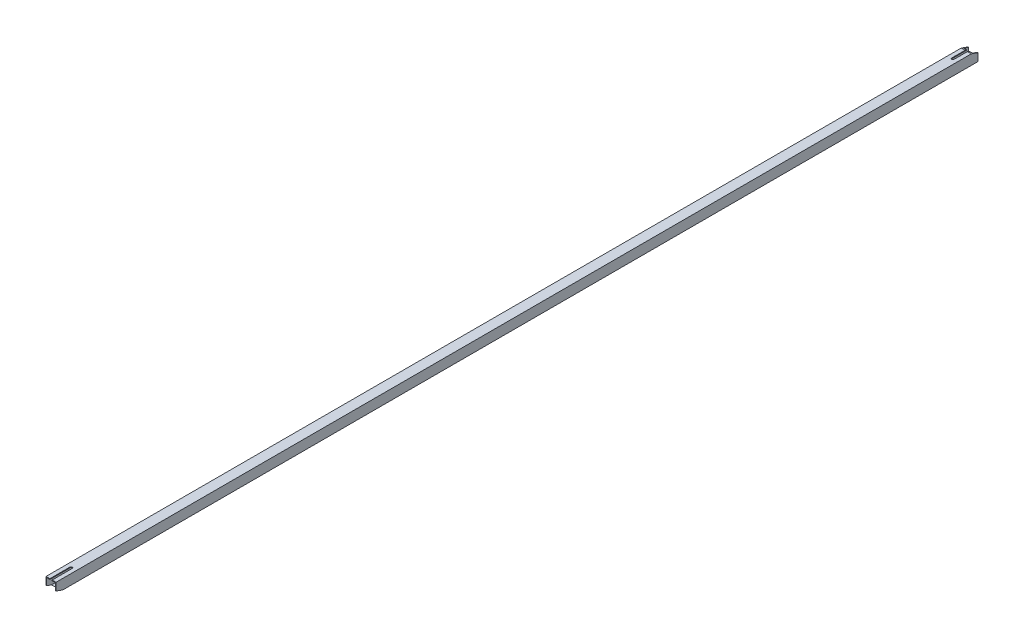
ISO-10303-21;
HEADER;
FILE_DESCRIPTION(('STEP AP214'),'2;1');
FILE_NAME('part.step','',(''),(''),'','','');
FILE_SCHEMA(('AUTOMOTIVE_DESIGN { 1 0 10303 214 1 1 1 1 }'));
ENDSEC;
DATA;
#1=APPLICATION_CONTEXT('core data for automotive mechanical design processes');
#2=APPLICATION_PROTOCOL_DEFINITION('international standard','automotive_design',2000,#1);
#3=PRODUCT_CONTEXT('',#1,'mechanical');
#4=PRODUCT('Part','Part','',(#3));
#5=PRODUCT_RELATED_PRODUCT_CATEGORY('part','',(#4));
#6=PRODUCT_DEFINITION_FORMATION('','',#4);
#7=PRODUCT_DEFINITION_CONTEXT('part definition',#1,'design');
#8=PRODUCT_DEFINITION('design','',#6,#7);
#9=PRODUCT_DEFINITION_SHAPE('','',#8);
#10=(LENGTH_UNIT() NAMED_UNIT(*) SI_UNIT(.MILLI.,.METRE.));
#11=(NAMED_UNIT(*) PLANE_ANGLE_UNIT() SI_UNIT($,.RADIAN.));
#12=(NAMED_UNIT(*) SI_UNIT($,.STERADIAN.) SOLID_ANGLE_UNIT());
#13=UNCERTAINTY_MEASURE_WITH_UNIT(LENGTH_MEASURE(1.E-05),#10,'distance_accuracy_value','');
#14=(GEOMETRIC_REPRESENTATION_CONTEXT(3) GLOBAL_UNCERTAINTY_ASSIGNED_CONTEXT((#13)) GLOBAL_UNIT_ASSIGNED_CONTEXT((#10,
#11,#12)) REPRESENTATION_CONTEXT('',''));
#15=CARTESIAN_POINT('',(0.,0.,0.));
#16=DIRECTION('',(0.,0.,1.));
#17=DIRECTION('',(1.,0.,0.));
#18=AXIS2_PLACEMENT_3D('',#15,#16,#17);
#19=CARTESIAN_POINT('',(7.,-40.,5379.965454));
#20=DIRECTION('',(1.,0.,0.));
#21=DIRECTION('',(0.,1.,0.));
#22=AXIS2_PLACEMENT_3D('',#19,#20,#21);
#23=PLANE('',#22);
#24=DIRECTION('',(0.,0.,1.));
#25=VECTOR('',#24,1.);
#26=CARTESIAN_POINT('',(7.,26.,2689.982727));
#27=LINE('',#26,#25);
#28=CARTESIAN_POINT('',(7.,26.,5379.965454));
#29=VERTEX_POINT('',#28);
#30=CARTESIAN_POINT('',(7.,26.,5499.965454));
#31=VERTEX_POINT('',#30);
#32=EDGE_CURVE('E403',#29,#31,#27,.T.);
#33=ORIENTED_EDGE('',*,*,#32,.T.);
#34=DIRECTION('',(0.,1.,0.));
#35=VECTOR('',#34,1.);
#36=CARTESIAN_POINT('',(7.,-20.,5499.965454));
#37=LINE('',#36,#35);
#38=CARTESIAN_POINT('',(7.,30.,5499.965454));
#39=VERTEX_POINT('',#38);
#40=EDGE_CURVE('E585',#31,#39,#37,.T.);
#41=ORIENTED_EDGE('',*,*,#40,.T.);
#42=DIRECTION('',(0.,0.,1.));
#43=VECTOR('',#42,1.);
#44=CARTESIAN_POINT('',(7.,30.,2689.982727));
#45=LINE('',#44,#43);
#46=CARTESIAN_POINT('',(7.,30.,5379.965454));
#47=VERTEX_POINT('',#46);
#48=EDGE_CURVE('E381',#47,#39,#45,.T.);
#49=ORIENTED_EDGE('',*,*,#48,.F.);
#50=DIRECTION('',(0.,1.,0.));
#51=VECTOR('',#50,1.);
#52=CARTESIAN_POINT('',(7.,-40.,5379.965454));
#53=LINE('',#52,#51);
#54=EDGE_CURVE('E10',#29,#47,#53,.T.);
#55=ORIENTED_EDGE('',*,*,#54,.F.);
#56=EDGE_LOOP('',(#33,#41,#49,#55));
#57=FACE_BOUND('',#56,.T.);
#58=ADVANCED_FACE('F16',(#57),#23,.F.);
#59=CARTESIAN_POINT('',(0.,-40.,5379.965454));
#60=DIRECTION('',(0.,1.,0.));
#61=DIRECTION('',(0.,0.,1.));
#62=AXIS2_PLACEMENT_3D('',#59,#60,#61);
#63=CYLINDRICAL_SURFACE('',#62,7.);
#64=ORIENTED_EDGE('',*,*,#54,.T.);
#65=CARTESIAN_POINT('',(0.,30.,5379.965454));
#66=DIRECTION('',(0.,1.,0.));
#67=DIRECTION('',(0.,0.,1.));
#68=AXIS2_PLACEMENT_3D('',#65,#66,#67);
#69=CIRCLE('',#68,7.);
#70=CARTESIAN_POINT('',(-7.,30.,5379.965454));
#71=VERTEX_POINT('',#70);
#72=EDGE_CURVE('E377',#47,#71,#69,.T.);
#73=ORIENTED_EDGE('',*,*,#72,.T.);
#74=DIRECTION('',(0.,1.,0.));
#75=VECTOR('',#74,1.);
#76=CARTESIAN_POINT('',(-7.,-40.,5379.965454));
#77=LINE('',#76,#75);
#78=CARTESIAN_POINT('',(-7.,26.,5379.965454));
#79=VERTEX_POINT('',#78);
#80=EDGE_CURVE('E19',#79,#71,#77,.T.);
#81=ORIENTED_EDGE('',*,*,#80,.F.);
#82=CARTESIAN_POINT('',(0.,26.,5379.965454));
#83=DIRECTION('',(0.,1.,0.));
#84=DIRECTION('',(0.,0.,1.));
#85=AXIS2_PLACEMENT_3D('',#82,#83,#84);
#86=CIRCLE('',#85,7.);
#87=EDGE_CURVE('E599',#29,#79,#86,.T.);
#88=ORIENTED_EDGE('',*,*,#87,.F.);
#89=EDGE_LOOP('',(#64,#73,#81,#88));
#90=FACE_BOUND('',#89,.T.);
#91=ADVANCED_FACE('F625',(#90),#63,.F.);
#92=CARTESIAN_POINT('',(-7.,-40.,5379.965454));
#93=DIRECTION('',(1.,0.,0.));
#94=DIRECTION('',(0.,1.,0.));
#95=AXIS2_PLACEMENT_3D('',#92,#93,#94);
#96=PLANE('',#95);
#97=ORIENTED_EDGE('',*,*,#80,.T.);
#98=DIRECTION('',(0.,0.,1.));
#99=VECTOR('',#98,1.);
#100=CARTESIAN_POINT('',(-7.,30.,2689.982727));
#101=LINE('',#100,#99);
#102=CARTESIAN_POINT('',(-7.,30.,5499.965454));
#103=VERTEX_POINT('',#102);
#104=EDGE_CURVE('E382',#71,#103,#101,.T.);
#105=ORIENTED_EDGE('',*,*,#104,.T.);
#106=DIRECTION('',(0.,1.,0.));
#107=VECTOR('',#106,1.);
#108=CARTESIAN_POINT('',(-7.,-20.,5499.965454));
#109=LINE('',#108,#107);
#110=CARTESIAN_POINT('',(-7.,26.,5499.965454));
#111=VERTEX_POINT('',#110);
#112=EDGE_CURVE('E340',#111,#103,#109,.T.);
#113=ORIENTED_EDGE('',*,*,#112,.F.);
#114=DIRECTION('',(0.,0.,1.));
#115=VECTOR('',#114,1.);
#116=CARTESIAN_POINT('',(-7.,26.,2689.982727));
#117=LINE('',#116,#115);
#118=EDGE_CURVE('E603',#79,#111,#117,.T.);
#119=ORIENTED_EDGE('',*,*,#118,.F.);
#120=EDGE_LOOP('',(#97,#105,#113,#119));
#121=FACE_BOUND('',#120,.T.);
#122=ADVANCED_FACE('F618',(#121),#96,.T.);
#123=CARTESIAN_POINT('',(0.,-40.,120.));
#124=DIRECTION('',(0.,1.,0.));
#125=DIRECTION('',(0.,0.,1.));
#126=AXIS2_PLACEMENT_3D('',#123,#124,#125);
#127=CYLINDRICAL_SURFACE('',#126,7.);
#128=CARTESIAN_POINT('',(0.,26.,120.));
#129=DIRECTION('',(0.,1.,0.));
#130=DIRECTION('',(0.,0.,1.));
#131=AXIS2_PLACEMENT_3D('',#128,#129,#130);
#132=CIRCLE('',#131,7.);
#133=CARTESIAN_POINT('',(-7.,26.,120.));
#134=VERTEX_POINT('',#133);
#135=CARTESIAN_POINT('',(0.,26.,127.));
#136=VERTEX_POINT('',#135);
#137=EDGE_CURVE('E555',#134,#136,#132,.T.);
#138=ORIENTED_EDGE('',*,*,#137,.F.);
#139=DIRECTION('',(0.,1.,0.));
#140=VECTOR('',#139,1.);
#141=CARTESIAN_POINT('',(-7.,-40.,120.));
#142=LINE('',#141,#140);
#143=CARTESIAN_POINT('',(-7.,30.,120.));
#144=VERTEX_POINT('',#143);
#145=EDGE_CURVE('E536',#134,#144,#142,.T.);
#146=ORIENTED_EDGE('',*,*,#145,.T.);
#147=CARTESIAN_POINT('',(0.,30.,120.));
#148=DIRECTION('',(0.,1.,0.));
#149=DIRECTION('',(0.,0.,1.));
#150=AXIS2_PLACEMENT_3D('',#147,#148,#149);
#151=CIRCLE('',#150,7.);
#152=CARTESIAN_POINT('',(0.,30.,127.));
#153=VERTEX_POINT('',#152);
#154=EDGE_CURVE('E575',#144,#153,#151,.T.);
#155=ORIENTED_EDGE('',*,*,#154,.T.);
#156=DIRECTION('',(0.,1.,0.));
#157=VECTOR('',#156,1.);
#158=CARTESIAN_POINT('',(0.,-40.,127.));
#159=LINE('',#158,#157);
#160=EDGE_CURVE('E47',#136,#153,#159,.T.);
#161=ORIENTED_EDGE('',*,*,#160,.F.);
#162=EDGE_LOOP('',(#138,#146,#155,#161));
#163=FACE_BOUND('',#162,.T.);
#164=ADVANCED_FACE('F660',(#163),#127,.F.);
#165=CARTESIAN_POINT('',(0.,-40.,120.));
#166=DIRECTION('',(0.,1.,0.));
#167=DIRECTION('',(0.,0.,1.));
#168=AXIS2_PLACEMENT_3D('',#165,#166,#167);
#169=CYLINDRICAL_SURFACE('',#168,7.);
#170=DIRECTION('',(0.,1.,0.));
#171=VECTOR('',#170,1.);
#172=CARTESIAN_POINT('',(7.,-40.,120.));
#173=LINE('',#172,#171);
#174=CARTESIAN_POINT('',(7.,26.,120.));
#175=VERTEX_POINT('',#174);
#176=CARTESIAN_POINT('',(7.,30.,120.));
#177=VERTEX_POINT('',#176);
#178=EDGE_CURVE('E37',#175,#177,#173,.T.);
#179=ORIENTED_EDGE('',*,*,#178,.F.);
#180=CARTESIAN_POINT('',(0.,26.,120.));
#181=DIRECTION('',(0.,1.,0.));
#182=DIRECTION('',(0.,0.,1.));
#183=AXIS2_PLACEMENT_3D('',#180,#181,#182);
#184=CIRCLE('',#183,7.);
#185=EDGE_CURVE('E559',#136,#175,#184,.T.);
#186=ORIENTED_EDGE('',*,*,#185,.F.);
#187=ORIENTED_EDGE('',*,*,#160,.T.);
#188=CARTESIAN_POINT('',(0.,30.,120.));
#189=DIRECTION('',(0.,1.,0.));
#190=DIRECTION('',(0.,0.,1.));
#191=AXIS2_PLACEMENT_3D('',#188,#189,#190);
#192=CIRCLE('',#191,7.);
#193=EDGE_CURVE('E572',#153,#177,#192,.T.);
#194=ORIENTED_EDGE('',*,*,#193,.T.);
#195=EDGE_LOOP('',(#179,#186,#187,#194));
#196=FACE_BOUND('',#195,.T.);
#197=ADVANCED_FACE('F658',(#196),#169,.F.);
#198=CARTESIAN_POINT('',(7.,-40.,-1.));
#199=DIRECTION('',(1.,0.,0.));
#200=DIRECTION('',(0.,1.,0.));
#201=AXIS2_PLACEMENT_3D('',#198,#199,#200);
#202=PLANE('',#201);
#203=DIRECTION('',(0.,0.,1.));
#204=VECTOR('',#203,1.);
#205=CARTESIAN_POINT('',(7.,30.,-0.5));
#206=LINE('',#205,#204);
#207=CARTESIAN_POINT('',(7.,30.,40.055048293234));
#208=VERTEX_POINT('',#207);
#209=EDGE_CURVE('E512',#208,#177,#206,.T.);
#210=ORIENTED_EDGE('',*,*,#209,.F.);
#211=DIRECTION('',(0.,0.332002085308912,0.943278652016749));
#212=VECTOR('',#211,1.);
#213=CARTESIAN_POINT('',(7.,11.788086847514,-11.68832817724));
#214=LINE('',#213,#212);
#215=CARTESIAN_POINT('',(7.,26.,28.690316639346));
#216=VERTEX_POINT('',#215);
#217=EDGE_CURVE('E513',#216,#208,#214,.T.);
#218=ORIENTED_EDGE('',*,*,#217,.F.);
#219=DIRECTION('',(0.,0.,1.));
#220=VECTOR('',#219,1.);
#221=CARTESIAN_POINT('',(7.,26.,-0.5));
#222=LINE('',#221,#220);
#223=EDGE_CURVE('E539',#216,#175,#222,.T.);
#224=ORIENTED_EDGE('',*,*,#223,.T.);
#225=ORIENTED_EDGE('',*,*,#178,.T.);
#226=EDGE_LOOP('',(#210,#218,#224,#225));
#227=FACE_BOUND('',#226,.T.);
#228=ADVANCED_FACE('F657',(#227),#202,.F.);
#229=CARTESIAN_POINT('',(-7.,-40.,-1.));
#230=DIRECTION('',(1.,0.,0.));
#231=DIRECTION('',(0.,1.,0.));
#232=AXIS2_PLACEMENT_3D('',#229,#230,#231);
#233=PLANE('',#232);
#234=ORIENTED_EDGE('',*,*,#145,.F.);
#235=DIRECTION('',(0.,0.,1.));
#236=VECTOR('',#235,1.);
#237=CARTESIAN_POINT('',(-7.,26.,-0.5));
#238=LINE('',#237,#236);
#239=CARTESIAN_POINT('',(-7.,26.,28.690316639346));
#240=VERTEX_POINT('',#239);
#241=EDGE_CURVE('E560',#240,#134,#238,.T.);
#242=ORIENTED_EDGE('',*,*,#241,.F.);
#243=DIRECTION('',(0.,0.332002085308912,0.943278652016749));
#244=VECTOR('',#243,1.);
#245=CARTESIAN_POINT('',(-7.,11.788086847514,-11.68832817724));
#246=LINE('',#245,#244);
#247=CARTESIAN_POINT('',(-7.,30.,40.055048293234));
#248=VERTEX_POINT('',#247);
#249=EDGE_CURVE('E314',#240,#248,#246,.T.);
#250=ORIENTED_EDGE('',*,*,#249,.T.);
#251=DIRECTION('',(0.,0.,1.));
#252=VECTOR('',#251,1.);
#253=CARTESIAN_POINT('',(-7.,30.,-0.5));
#254=LINE('',#253,#252);
#255=EDGE_CURVE('E578',#248,#144,#254,.T.);
#256=ORIENTED_EDGE('',*,*,#255,.T.);
#257=EDGE_LOOP('',(#234,#242,#250,#256));
#258=FACE_BOUND('',#257,.T.);
#259=ADVANCED_FACE('F667',(#258),#233,.T.);
#260=CARTESIAN_POINT('',(26.,26.,0.));
#261=DIRECTION('',(0.,-1.,0.));
#262=DIRECTION('',(0.,0.,-1.));
#263=AXIS2_PLACEMENT_3D('',#260,#261,#262);
#264=PLANE('',#263);
#265=DIRECTION('',(-1.,0.,0.));
#266=VECTOR('',#265,1.);
#267=CARTESIAN_POINT('',(13.,26.,28.690316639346));
#268=LINE('',#267,#266);
#269=CARTESIAN_POINT('',(26.,26.,28.690316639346));
#270=VERTEX_POINT('',#269);
#271=EDGE_CURVE('E554',#270,#216,#268,.T.);
#272=ORIENTED_EDGE('',*,*,#271,.F.);
#273=DIRECTION('',(0.,0.,1.));
#274=VECTOR('',#273,1.);
#275=CARTESIAN_POINT('',(26.,26.,0.));
#276=LINE('',#275,#274);
#277=CARTESIAN_POINT('',(26.,26.,5499.965454));
#278=VERTEX_POINT('',#277);
#279=EDGE_CURVE('E546',#270,#278,#276,.T.);
#280=ORIENTED_EDGE('',*,*,#279,.T.);
#281=DIRECTION('',(-1.,0.,0.));
#282=VECTOR('',#281,1.);
#283=CARTESIAN_POINT('',(26.,26.,5499.965454));
#284=LINE('',#283,#282);
#285=EDGE_CURVE('E341',#278,#31,#284,.T.);
#286=ORIENTED_EDGE('',*,*,#285,.T.);
#287=ORIENTED_EDGE('',*,*,#32,.F.);
#288=ORIENTED_EDGE('',*,*,#87,.T.);
#289=ORIENTED_EDGE('',*,*,#118,.T.);
#290=DIRECTION('',(-1.,0.,0.));
#291=VECTOR('',#290,1.);
#292=CARTESIAN_POINT('',(26.,26.,5499.965454));
#293=LINE('',#292,#291);
#294=CARTESIAN_POINT('',(-26.,26.,5499.965454));
#295=VERTEX_POINT('',#294);
#296=EDGE_CURVE('E337',#111,#295,#293,.T.);
#297=ORIENTED_EDGE('',*,*,#296,.T.);
#298=DIRECTION('',(0.,0.,1.));
#299=VECTOR('',#298,1.);
#300=CARTESIAN_POINT('',(-26.,26.,0.));
#301=LINE('',#300,#299);
#302=CARTESIAN_POINT('',(-26.,26.,28.690316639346));
#303=VERTEX_POINT('',#302);
#304=EDGE_CURVE('E342',#303,#295,#301,.T.);
#305=ORIENTED_EDGE('',*,*,#304,.F.);
#306=DIRECTION('',(-1.,0.,0.));
#307=VECTOR('',#306,1.);
#308=CARTESIAN_POINT('',(13.,26.,28.690316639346));
#309=LINE('',#308,#307);
#310=EDGE_CURVE('E347',#240,#303,#309,.T.);
#311=ORIENTED_EDGE('',*,*,#310,.F.);
#312=ORIENTED_EDGE('',*,*,#241,.T.);
#313=ORIENTED_EDGE('',*,*,#137,.T.);
#314=ORIENTED_EDGE('',*,*,#185,.T.);
#315=ORIENTED_EDGE('',*,*,#223,.F.);
#316=EDGE_LOOP('',(#272,#280,#286,#287,#288,#289,#297,#305,#311,#312,#313,#314,#315));
#317=FACE_BOUND('',#316,.T.);
#318=ADVANCED_FACE('F637',(#317),#264,.T.);
#319=CARTESIAN_POINT('',(0.,0.,5499.965454));
#320=DIRECTION('',(0.,0.,1.));
#321=DIRECTION('',(1.,0.,0.));
#322=AXIS2_PLACEMENT_3D('',#319,#320,#321);
#323=PLANE('',#322);
#324=DIRECTION('',(-1.,0.,0.));
#325=VECTOR('',#324,1.);
#326=CARTESIAN_POINT('',(30.,30.,5499.965454));
#327=LINE('',#326,#325);
#328=CARTESIAN_POINT('',(-30.,30.,5499.965454));
#329=VERTEX_POINT('',#328);
#330=EDGE_CURVE('E582',#103,#329,#327,.T.);
#331=ORIENTED_EDGE('',*,*,#330,.T.);
#332=DIRECTION('',(0.,-1.,0.));
#333=VECTOR('',#332,1.);
#334=CARTESIAN_POINT('',(-30.,30.,5499.965454));
#335=LINE('',#334,#333);
#336=CARTESIAN_POINT('',(-30.,-15.9019819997,5499.965454));
#337=VERTEX_POINT('',#336);
#338=EDGE_CURVE('E330',#329,#337,#335,.T.);
#339=ORIENTED_EDGE('',*,*,#338,.T.);
#340=DIRECTION('',(-1.,0.,0.));
#341=VECTOR('',#340,1.);
#342=CARTESIAN_POINT('',(0.,-15.9019819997,5499.965454));
#343=LINE('',#342,#341);
#344=CARTESIAN_POINT('',(-26.,-15.9019819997,5499.965454));
#345=VERTEX_POINT('',#344);
#346=EDGE_CURVE('E331',#345,#337,#343,.T.);
#347=ORIENTED_EDGE('',*,*,#346,.F.);
#348=DIRECTION('',(0.,-1.,0.));
#349=VECTOR('',#348,1.);
#350=CARTESIAN_POINT('',(-26.,26.,5499.965454));
#351=LINE('',#350,#349);
#352=EDGE_CURVE('E346',#295,#345,#351,.T.);
#353=ORIENTED_EDGE('',*,*,#352,.F.);
#354=ORIENTED_EDGE('',*,*,#296,.F.);
#355=ORIENTED_EDGE('',*,*,#112,.T.);
#356=EDGE_LOOP('',(#331,#339,#347,#353,#354,#355));
#357=FACE_BOUND('',#356,.T.);
#358=ADVANCED_FACE('F632',(#357),#323,.T.);
#359=CARTESIAN_POINT('',(0.,0.,5499.965454));
#360=DIRECTION('',(0.,0.,1.));
#361=DIRECTION('',(1.,0.,0.));
#362=AXIS2_PLACEMENT_3D('',#359,#360,#361);
#363=PLANE('',#362);
#364=DIRECTION('',(-1.,0.,0.));
#365=VECTOR('',#364,1.);
#366=CARTESIAN_POINT('',(30.,30.,5499.965454));
#367=LINE('',#366,#365);
#368=CARTESIAN_POINT('',(30.,30.,5499.965454));
#369=VERTEX_POINT('',#368);
#370=EDGE_CURVE('E442',#369,#39,#367,.T.);
#371=ORIENTED_EDGE('',*,*,#370,.T.);
#372=ORIENTED_EDGE('',*,*,#40,.F.);
#373=ORIENTED_EDGE('',*,*,#285,.F.);
#374=DIRECTION('',(0.,1.,0.));
#375=VECTOR('',#374,1.);
#376=CARTESIAN_POINT('',(26.,-26.,5499.965454));
#377=LINE('',#376,#375);
#378=CARTESIAN_POINT('',(26.,-15.9019819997,5499.965454));
#379=VERTEX_POINT('',#378);
#380=EDGE_CURVE('E542',#379,#278,#377,.T.);
#381=ORIENTED_EDGE('',*,*,#380,.F.);
#382=DIRECTION('',(-1.,0.,0.));
#383=VECTOR('',#382,1.);
#384=CARTESIAN_POINT('',(0.,-15.9019819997,5499.965454));
#385=LINE('',#384,#383);
#386=CARTESIAN_POINT('',(30.,-15.9019819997,5499.965454));
#387=VERTEX_POINT('',#386);
#388=EDGE_CURVE('E386',#387,#379,#385,.T.);
#389=ORIENTED_EDGE('',*,*,#388,.F.);
#390=DIRECTION('',(0.,1.,0.));
#391=VECTOR('',#390,1.);
#392=CARTESIAN_POINT('',(30.,-30.,5499.965454));
#393=LINE('',#392,#391);
#394=EDGE_CURVE('E472',#387,#369,#393,.T.);
#395=ORIENTED_EDGE('',*,*,#394,.T.);
#396=EDGE_LOOP('',(#371,#372,#373,#381,#389,#395));
#397=FACE_BOUND('',#396,.T.);
#398=ADVANCED_FACE('F645',(#397),#363,.T.);
#399=CARTESIAN_POINT('',(30.,30.,0.));
#400=DIRECTION('',(0.,-1.,0.));
#401=DIRECTION('',(0.,0.,-1.));
#402=AXIS2_PLACEMENT_3D('',#399,#400,#401);
#403=PLANE('',#402);
#404=ORIENTED_EDGE('',*,*,#209,.T.);
#405=ORIENTED_EDGE('',*,*,#193,.F.);
#406=ORIENTED_EDGE('',*,*,#154,.F.);
#407=ORIENTED_EDGE('',*,*,#255,.F.);
#408=DIRECTION('',(-1.,0.,0.));
#409=VECTOR('',#408,1.);
#410=CARTESIAN_POINT('',(15.,30.,40.055048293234));
#411=LINE('',#410,#409);
#412=CARTESIAN_POINT('',(-30.,30.,40.055048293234));
#413=VERTEX_POINT('',#412);
#414=EDGE_CURVE('E412',#248,#413,#411,.T.);
#415=ORIENTED_EDGE('',*,*,#414,.T.);
#416=DIRECTION('',(0.,0.,1.));
#417=VECTOR('',#416,1.);
#418=CARTESIAN_POINT('',(-30.,30.,0.));
#419=LINE('',#418,#417);
#420=EDGE_CURVE('E519',#413,#329,#419,.T.);
#421=ORIENTED_EDGE('',*,*,#420,.T.);
#422=ORIENTED_EDGE('',*,*,#330,.F.);
#423=ORIENTED_EDGE('',*,*,#104,.F.);
#424=ORIENTED_EDGE('',*,*,#72,.F.);
#425=ORIENTED_EDGE('',*,*,#48,.T.);
#426=ORIENTED_EDGE('',*,*,#370,.F.);
#427=DIRECTION('',(0.,0.,1.));
#428=VECTOR('',#427,1.);
#429=CARTESIAN_POINT('',(30.,30.,0.));
#430=LINE('',#429,#428);
#431=CARTESIAN_POINT('',(30.,30.,40.055048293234));
#432=VERTEX_POINT('',#431);
#433=EDGE_CURVE('E468',#432,#369,#430,.T.);
#434=ORIENTED_EDGE('',*,*,#433,.F.);
#435=DIRECTION('',(-1.,0.,0.));
#436=VECTOR('',#435,1.);
#437=CARTESIAN_POINT('',(15.,30.,40.055048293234));
#438=LINE('',#437,#436);
#439=EDGE_CURVE('E508',#432,#208,#438,.T.);
#440=ORIENTED_EDGE('',*,*,#439,.T.);
#441=EDGE_LOOP('',(#404,#405,#406,#407,#415,#421,#422,#423,#424,#425,#426,#434,#440));
#442=FACE_BOUND('',#441,.T.);
#443=ADVANCED_FACE('F628',(#442),#403,.F.);
#444=CARTESIAN_POINT('',(0.,14.149179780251,-4.980031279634));
#445=DIRECTION('',(0.,-0.943278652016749,0.332002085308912));
#446=DIRECTION('',(-1.,0.,0.));
#447=AXIS2_PLACEMENT_3D('',#444,#445,#446);
#448=PLANE('',#447);
#449=ORIENTED_EDGE('',*,*,#271,.T.);
#450=ORIENTED_EDGE('',*,*,#217,.T.);
#451=ORIENTED_EDGE('',*,*,#439,.F.);
#452=DIRECTION('',(0.,0.332002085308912,0.943278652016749));
#453=VECTOR('',#452,1.);
#454=CARTESIAN_POINT('',(30.,12.495799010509,-9.677588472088));
#455=LINE('',#454,#453);
#456=CARTESIAN_POINT('',(30.,15.901981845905,0.));
#457=VERTEX_POINT('',#456);
#458=EDGE_CURVE('E464',#457,#432,#455,.T.);
#459=ORIENTED_EDGE('',*,*,#458,.F.);
#460=DIRECTION('',(1.,0.,0.));
#461=VECTOR('',#460,1.);
#462=CARTESIAN_POINT('',(0.,15.901981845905,0.));
#463=LINE('',#462,#461);
#464=CARTESIAN_POINT('',(26.,15.901981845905,0.));
#465=VERTEX_POINT('',#464);
#466=EDGE_CURVE('E392',#465,#457,#463,.T.);
#467=ORIENTED_EDGE('',*,*,#466,.F.);
#468=DIRECTION('',(0.,0.332002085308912,0.943278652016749));
#469=VECTOR('',#468,1.);
#470=CARTESIAN_POINT('',(26.,12.716249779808,-9.051247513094));
#471=LINE('',#470,#469);
#472=EDGE_CURVE('E550',#465,#270,#471,.T.);
#473=ORIENTED_EDGE('',*,*,#472,.T.);
#474=EDGE_LOOP('',(#449,#450,#451,#459,#467,#473));
#475=FACE_BOUND('',#474,.T.);
#476=ADVANCED_FACE('F652',(#475),#448,.F.);
#477=CARTESIAN_POINT('',(26.,-26.,0.));
#478=DIRECTION('',(-1.,0.,0.));
#479=DIRECTION('',(0.,0.,1.));
#480=AXIS2_PLACEMENT_3D('',#477,#478,#479);
#481=PLANE('',#480);
#482=DIRECTION('',(0.,1.,0.));
#483=VECTOR('',#482,1.);
#484=CARTESIAN_POINT('',(26.,-26.,0.));
#485=LINE('',#484,#483);
#486=CARTESIAN_POINT('',(26.,-26.,0.));
#487=VERTEX_POINT('',#486);
#488=EDGE_CURVE('E388',#487,#465,#485,.T.);
#489=ORIENTED_EDGE('',*,*,#488,.F.);
#490=DIRECTION('',(0.,0.,1.));
#491=VECTOR('',#490,1.);
#492=CARTESIAN_POINT('',(26.,-26.,0.));
#493=LINE('',#492,#491);
#494=CARTESIAN_POINT('',(26.,-26.,5471.275137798));
#495=VERTEX_POINT('',#494);
#496=EDGE_CURVE('E535',#487,#495,#493,.T.);
#497=ORIENTED_EDGE('',*,*,#496,.T.);
#498=DIRECTION('',(0.,-0.332002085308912,-0.943278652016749));
#499=VECTOR('',#498,1.);
#500=CARTESIAN_POINT('',(26.,-1738.008928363,607.14462282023));
#501=LINE('',#500,#499);
#502=EDGE_CURVE('E476',#379,#495,#501,.T.);
#503=ORIENTED_EDGE('',*,*,#502,.F.);
#504=ORIENTED_EDGE('',*,*,#380,.T.);
#505=ORIENTED_EDGE('',*,*,#279,.F.);
#506=ORIENTED_EDGE('',*,*,#472,.F.);
#507=EDGE_LOOP('',(#489,#497,#503,#504,#505,#506));
#508=FACE_BOUND('',#507,.T.);
#509=ADVANCED_FACE('F753',(#508),#481,.T.);
#510=CARTESIAN_POINT('',(-26.,-26.,0.));
#511=DIRECTION('',(0.,1.,0.));
#512=DIRECTION('',(1.,0.,0.));
#513=AXIS2_PLACEMENT_3D('',#510,#511,#512);
#514=PLANE('',#513);
#515=DIRECTION('',(1.,0.,0.));
#516=VECTOR('',#515,1.);
#517=CARTESIAN_POINT('',(-26.,-26.,0.));
#518=LINE('',#517,#516);
#519=CARTESIAN_POINT('',(-26.,-26.,0.));
#520=VERTEX_POINT('',#519);
#521=CARTESIAN_POINT('',(-7.,-26.,0.));
#522=VERTEX_POINT('',#521);
#523=EDGE_CURVE('E350',#520,#522,#518,.T.);
#524=ORIENTED_EDGE('',*,*,#523,.F.);
#525=DIRECTION('',(0.,0.,1.));
#526=VECTOR('',#525,1.);
#527=CARTESIAN_POINT('',(-26.,-26.,0.));
#528=LINE('',#527,#526);
#529=CARTESIAN_POINT('',(-26.,-26.,5471.275137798));
#530=VERTEX_POINT('',#529);
#531=EDGE_CURVE('E532',#520,#530,#528,.T.);
#532=ORIENTED_EDGE('',*,*,#531,.T.);
#533=DIRECTION('',(-1.,0.,0.));
#534=VECTOR('',#533,1.);
#535=CARTESIAN_POINT('',(-13.,-25.99999999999,5471.275137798));
#536=LINE('',#535,#534);
#537=CARTESIAN_POINT('',(-7.,-25.99999999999,5471.275137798));
#538=VERTEX_POINT('',#537);
#539=EDGE_CURVE('E428',#538,#530,#536,.T.);
#540=ORIENTED_EDGE('',*,*,#539,.F.);
#541=DIRECTION('',(0.,0.,-1.));
#542=VECTOR('',#541,1.);
#543=CARTESIAN_POINT('',(-7.,-26.,2689.982727));
#544=LINE('',#543,#542);
#545=CARTESIAN_POINT('',(-7.,-26.,5379.965454));
#546=VERTEX_POINT('',#545);
#547=EDGE_CURVE('E367',#538,#546,#544,.T.);
#548=ORIENTED_EDGE('',*,*,#547,.T.);
#549=CARTESIAN_POINT('',(0.,-26.,5379.965454));
#550=DIRECTION('',(0.,1.,0.));
#551=DIRECTION('',(0.,0.,1.));
#552=AXIS2_PLACEMENT_3D('',#549,#550,#551);
#553=CIRCLE('',#552,7.);
#554=CARTESIAN_POINT('',(7.,-26.,5379.965454));
#555=VERTEX_POINT('',#554);
#556=EDGE_CURVE('E368',#555,#546,#553,.T.);
#557=ORIENTED_EDGE('',*,*,#556,.F.);
#558=DIRECTION('',(0.,0.,-1.));
#559=VECTOR('',#558,1.);
#560=CARTESIAN_POINT('',(7.,-26.,2689.982727));
#561=LINE('',#560,#559);
#562=CARTESIAN_POINT('',(7.,-25.99999999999,5471.275137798));
#563=VERTEX_POINT('',#562);
#564=EDGE_CURVE('E489',#563,#555,#561,.T.);
#565=ORIENTED_EDGE('',*,*,#564,.F.);
#566=DIRECTION('',(-1.,0.,0.));
#567=VECTOR('',#566,1.);
#568=CARTESIAN_POINT('',(-13.,-25.99999999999,5471.275137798));
#569=LINE('',#568,#567);
#570=EDGE_CURVE('E387',#495,#563,#569,.T.);
#571=ORIENTED_EDGE('',*,*,#570,.F.);
#572=ORIENTED_EDGE('',*,*,#496,.F.);
#573=DIRECTION('',(1.,0.,0.));
#574=VECTOR('',#573,1.);
#575=CARTESIAN_POINT('',(-26.,-26.,0.));
#576=LINE('',#575,#574);
#577=CARTESIAN_POINT('',(7.,-26.,0.));
#578=VERTEX_POINT('',#577);
#579=EDGE_CURVE('E393',#578,#487,#576,.T.);
#580=ORIENTED_EDGE('',*,*,#579,.F.);
#581=DIRECTION('',(0.,0.,-1.));
#582=VECTOR('',#581,1.);
#583=CARTESIAN_POINT('',(7.,-26.,-0.5));
#584=LINE('',#583,#582);
#585=CARTESIAN_POINT('',(7.,-26.,120.));
#586=VERTEX_POINT('',#585);
#587=EDGE_CURVE('E446',#586,#578,#584,.T.);
#588=ORIENTED_EDGE('',*,*,#587,.F.);
#589=CARTESIAN_POINT('',(0.,-26.,120.));
#590=DIRECTION('',(0.,1.,0.));
#591=DIRECTION('',(0.,0.,1.));
#592=AXIS2_PLACEMENT_3D('',#589,#590,#591);
#593=CIRCLE('',#592,7.);
#594=CARTESIAN_POINT('',(0.,-26.,127.));
#595=VERTEX_POINT('',#594);
#596=EDGE_CURVE('E438',#595,#586,#593,.T.);
#597=ORIENTED_EDGE('',*,*,#596,.F.);
#598=CARTESIAN_POINT('',(0.,-26.,120.));
#599=DIRECTION('',(0.,1.,0.));
#600=DIRECTION('',(0.,0.,1.));
#601=AXIS2_PLACEMENT_3D('',#598,#599,#600);
#602=CIRCLE('',#601,7.);
#603=CARTESIAN_POINT('',(-7.,-26.,120.));
#604=VERTEX_POINT('',#603);
#605=EDGE_CURVE('E317',#604,#595,#602,.T.);
#606=ORIENTED_EDGE('',*,*,#605,.F.);
#607=DIRECTION('',(0.,0.,-1.));
#608=VECTOR('',#607,1.);
#609=CARTESIAN_POINT('',(-7.,-26.,-0.5));
#610=LINE('',#609,#608);
#611=EDGE_CURVE('E287',#604,#522,#610,.T.);
#612=ORIENTED_EDGE('',*,*,#611,.T.);
#613=EDGE_LOOP('',(#524,#532,#540,#548,#557,#565,#571,#572,#580,#588,#597,#606,#612));
#614=FACE_BOUND('',#613,.T.);
#615=ADVANCED_FACE('F762',(#614),#514,.T.);
#616=CARTESIAN_POINT('',(-26.,26.,0.));
#617=DIRECTION('',(1.,0.,0.));
#618=DIRECTION('',(0.,1.,0.));
#619=AXIS2_PLACEMENT_3D('',#616,#617,#618);
#620=PLANE('',#619);
#621=DIRECTION('',(0.,-0.332002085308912,-0.943278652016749));
#622=VECTOR('',#621,1.);
#623=CARTESIAN_POINT('',(-26.,15.582109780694,-0.908815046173));
#624=LINE('',#623,#622);
#625=CARTESIAN_POINT('',(-26.,15.901981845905,0.));
#626=VERTEX_POINT('',#625);
#627=EDGE_CURVE('E409',#303,#626,#624,.T.);
#628=ORIENTED_EDGE('',*,*,#627,.F.);
#629=ORIENTED_EDGE('',*,*,#304,.T.);
#630=ORIENTED_EDGE('',*,*,#352,.T.);
#631=DIRECTION('',(0.,0.332002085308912,0.943278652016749));
#632=VECTOR('',#631,1.);
#633=CARTESIAN_POINT('',(-26.,-1735.143068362,615.28705528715));
#634=LINE('',#633,#632);
#635=EDGE_CURVE('E424',#530,#345,#634,.T.);
#636=ORIENTED_EDGE('',*,*,#635,.F.);
#637=ORIENTED_EDGE('',*,*,#531,.F.);
#638=DIRECTION('',(0.,-1.,0.));
#639=VECTOR('',#638,1.);
#640=CARTESIAN_POINT('',(-26.,26.,0.));
#641=LINE('',#640,#639);
#642=EDGE_CURVE('E354',#626,#520,#641,.T.);
#643=ORIENTED_EDGE('',*,*,#642,.F.);
#644=EDGE_LOOP('',(#628,#629,#630,#636,#637,#643));
#645=FACE_BOUND('',#644,.T.);
#646=ADVANCED_FACE('F772',(#645),#620,.T.);
#647=CARTESIAN_POINT('',(0.,14.149179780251,-4.980031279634));
#648=DIRECTION('',(0.,-0.943278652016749,0.332002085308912));
#649=DIRECTION('',(-1.,0.,0.));
#650=AXIS2_PLACEMENT_3D('',#647,#648,#649);
#651=PLANE('',#650);
#652=ORIENTED_EDGE('',*,*,#627,.T.);
#653=DIRECTION('',(1.,0.,0.));
#654=VECTOR('',#653,1.);
#655=CARTESIAN_POINT('',(0.,15.901981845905,0.));
#656=LINE('',#655,#654);
#657=CARTESIAN_POINT('',(-30.,15.901981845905,0.));
#658=VERTEX_POINT('',#657);
#659=EDGE_CURVE('E291',#658,#626,#656,.T.);
#660=ORIENTED_EDGE('',*,*,#659,.F.);
#661=DIRECTION('',(0.,-0.332002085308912,-0.943278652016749));
#662=VECTOR('',#661,1.);
#663=CARTESIAN_POINT('',(-30.,15.802560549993,-0.28247408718));
#664=LINE('',#663,#662);
#665=EDGE_CURVE('E413',#413,#658,#664,.T.);
#666=ORIENTED_EDGE('',*,*,#665,.F.);
#667=ORIENTED_EDGE('',*,*,#414,.F.);
#668=ORIENTED_EDGE('',*,*,#249,.F.);
#669=ORIENTED_EDGE('',*,*,#310,.T.);
#670=EDGE_LOOP('',(#652,#660,#666,#667,#668,#669));
#671=FACE_BOUND('',#670,.T.);
#672=ADVANCED_FACE('F783',(#671),#651,.F.);
#673=CARTESIAN_POINT('',(-30.,30.,0.));
#674=DIRECTION('',(1.,0.,0.));
#675=DIRECTION('',(0.,1.,0.));
#676=AXIS2_PLACEMENT_3D('',#673,#674,#675);
#677=PLANE('',#676);
#678=DIRECTION('',(0.,-1.,0.));
#679=VECTOR('',#678,1.);
#680=CARTESIAN_POINT('',(-30.,30.,0.));
#681=LINE('',#680,#679);
#682=CARTESIAN_POINT('',(-30.,-30.,0.));
#683=VERTEX_POINT('',#682);
#684=EDGE_CURVE('E421',#658,#683,#681,.T.);
#685=ORIENTED_EDGE('',*,*,#684,.T.);
#686=DIRECTION('',(0.,0.,1.));
#687=VECTOR('',#686,1.);
#688=CARTESIAN_POINT('',(-30.,-30.,0.));
#689=LINE('',#688,#687);
#690=CARTESIAN_POINT('',(-30.,-30.,5459.910406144));
#691=VERTEX_POINT('',#690);
#692=EDGE_CURVE('E324',#683,#691,#689,.T.);
#693=ORIENTED_EDGE('',*,*,#692,.T.);
#694=DIRECTION('',(0.,0.332002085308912,0.943278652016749));
#695=VECTOR('',#694,1.);
#696=CARTESIAN_POINT('',(-30.,-1734.922617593,615.91339624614));
#697=LINE('',#696,#695);
#698=EDGE_CURVE('E326',#691,#337,#697,.T.);
#699=ORIENTED_EDGE('',*,*,#698,.T.);
#700=ORIENTED_EDGE('',*,*,#338,.F.);
#701=ORIENTED_EDGE('',*,*,#420,.F.);
#702=ORIENTED_EDGE('',*,*,#665,.T.);
#703=EDGE_LOOP('',(#685,#693,#699,#700,#701,#702));
#704=FACE_BOUND('',#703,.T.);
#705=ADVANCED_FACE('F794',(#704),#677,.F.);
#706=CARTESIAN_POINT('',(0.,-1736.575998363,611.21583905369));
#707=DIRECTION('',(0.,0.943278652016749,-0.332002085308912));
#708=DIRECTION('',(-1.,0.,0.));
#709=AXIS2_PLACEMENT_3D('',#706,#707,#708);
#710=PLANE('',#709);
#711=ORIENTED_EDGE('',*,*,#539,.T.);
#712=ORIENTED_EDGE('',*,*,#635,.T.);
#713=ORIENTED_EDGE('',*,*,#346,.T.);
#714=ORIENTED_EDGE('',*,*,#698,.F.);
#715=DIRECTION('',(-1.,0.,0.));
#716=VECTOR('',#715,1.);
#717=CARTESIAN_POINT('',(-15.,-29.99999999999,5459.910406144));
#718=LINE('',#717,#716);
#719=CARTESIAN_POINT('',(-7.,-29.99999999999,5459.910406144));
#720=VERTEX_POINT('',#719);
#721=EDGE_CURVE('E320',#720,#691,#718,.T.);
#722=ORIENTED_EDGE('',*,*,#721,.F.);
#723=DIRECTION('',(0.,-0.332002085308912,-0.943278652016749));
#724=VECTOR('',#723,1.);
#725=CARTESIAN_POINT('',(-7.,-896.3573256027,2998.43077568));
#726=LINE('',#725,#724);
#727=EDGE_CURVE('E502',#538,#720,#726,.T.);
#728=ORIENTED_EDGE('',*,*,#727,.F.);
#729=EDGE_LOOP('',(#711,#712,#713,#714,#722,#728));
#730=FACE_BOUND('',#729,.T.);
#731=ADVANCED_FACE('F805',(#730),#710,.F.);
#732=CARTESIAN_POINT('',(-7.,-40.,5379.965454));
#733=DIRECTION('',(1.,0.,0.));
#734=DIRECTION('',(0.,1.,0.));
#735=AXIS2_PLACEMENT_3D('',#732,#733,#734);
#736=PLANE('',#735);
#737=DIRECTION('',(0.,0.,-1.));
#738=VECTOR('',#737,1.);
#739=CARTESIAN_POINT('',(-7.,-30.,2689.982727));
#740=LINE('',#739,#738);
#741=CARTESIAN_POINT('',(-7.,-30.,5379.965454));
#742=VERTEX_POINT('',#741);
#743=EDGE_CURVE('E325',#720,#742,#740,.T.);
#744=ORIENTED_EDGE('',*,*,#743,.T.);
#745=DIRECTION('',(0.,1.,0.));
#746=VECTOR('',#745,1.);
#747=CARTESIAN_POINT('',(-7.,-40.,5379.965454));
#748=LINE('',#747,#746);
#749=EDGE_CURVE('E363',#742,#546,#748,.T.);
#750=ORIENTED_EDGE('',*,*,#749,.T.);
#751=ORIENTED_EDGE('',*,*,#547,.F.);
#752=ORIENTED_EDGE('',*,*,#727,.T.);
#753=EDGE_LOOP('',(#744,#750,#751,#752));
#754=FACE_BOUND('',#753,.T.);
#755=ADVANCED_FACE('F815',(#754),#736,.T.);
#756=CARTESIAN_POINT('',(0.,-40.,5379.965454));
#757=DIRECTION('',(0.,1.,0.));
#758=DIRECTION('',(0.,0.,1.));
#759=AXIS2_PLACEMENT_3D('',#756,#757,#758);
#760=CYLINDRICAL_SURFACE('',#759,7.);
#761=ORIENTED_EDGE('',*,*,#556,.T.);
#762=ORIENTED_EDGE('',*,*,#749,.F.);
#763=CARTESIAN_POINT('',(0.,-30.,5379.965454));
#764=DIRECTION('',(0.,1.,0.));
#765=DIRECTION('',(0.,0.,1.));
#766=AXIS2_PLACEMENT_3D('',#763,#764,#765);
#767=CIRCLE('',#766,7.);
#768=CARTESIAN_POINT('',(7.,-30.,5379.965454));
#769=VERTEX_POINT('',#768);
#770=EDGE_CURVE('E376',#769,#742,#767,.T.);
#771=ORIENTED_EDGE('',*,*,#770,.F.);
#772=DIRECTION('',(0.,1.,0.));
#773=VECTOR('',#772,1.);
#774=CARTESIAN_POINT('',(7.,-40.,5379.965454));
#775=LINE('',#774,#773);
#776=EDGE_CURVE('E493',#769,#555,#775,.T.);
#777=ORIENTED_EDGE('',*,*,#776,.T.);
#778=EDGE_LOOP('',(#761,#762,#771,#777));
#779=FACE_BOUND('',#778,.T.);
#780=ADVANCED_FACE('F825',(#779),#760,.F.);
#781=CARTESIAN_POINT('',(7.,-40.,5379.965454));
#782=DIRECTION('',(1.,0.,0.));
#783=DIRECTION('',(0.,1.,0.));
#784=AXIS2_PLACEMENT_3D('',#781,#782,#783);
#785=PLANE('',#784);
#786=DIRECTION('',(0.,-0.332002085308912,-0.943278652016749));
#787=VECTOR('',#786,1.);
#788=CARTESIAN_POINT('',(7.,-896.3573256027,2998.43077568));
#789=LINE('',#788,#787);
#790=CARTESIAN_POINT('',(7.,-29.99999999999,5459.910406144));
#791=VERTEX_POINT('',#790);
#792=EDGE_CURVE('E383',#563,#791,#789,.T.);
#793=ORIENTED_EDGE('',*,*,#792,.F.);
#794=ORIENTED_EDGE('',*,*,#564,.T.);
#795=ORIENTED_EDGE('',*,*,#776,.F.);
#796=DIRECTION('',(0.,0.,-1.));
#797=VECTOR('',#796,1.);
#798=CARTESIAN_POINT('',(7.,-30.,2689.982727));
#799=LINE('',#798,#797);
#800=EDGE_CURVE('E397',#791,#769,#799,.T.);
#801=ORIENTED_EDGE('',*,*,#800,.F.);
#802=EDGE_LOOP('',(#793,#794,#795,#801));
#803=FACE_BOUND('',#802,.T.);
#804=ADVANCED_FACE('F836',(#803),#785,.F.);
#805=CARTESIAN_POINT('',(0.,-1736.575998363,611.21583905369));
#806=DIRECTION('',(0.,0.943278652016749,-0.332002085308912));
#807=DIRECTION('',(-1.,0.,0.));
#808=AXIS2_PLACEMENT_3D('',#805,#806,#807);
#809=PLANE('',#808);
#810=ORIENTED_EDGE('',*,*,#502,.T.);
#811=ORIENTED_EDGE('',*,*,#570,.T.);
#812=ORIENTED_EDGE('',*,*,#792,.T.);
#813=DIRECTION('',(-1.,0.,0.));
#814=VECTOR('',#813,1.);
#815=CARTESIAN_POINT('',(-15.,-29.99999999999,5459.910406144));
#816=LINE('',#815,#814);
#817=CARTESIAN_POINT('',(30.,-30.,5459.910406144));
#818=VERTEX_POINT('',#817);
#819=EDGE_CURVE('E372',#818,#791,#816,.T.);
#820=ORIENTED_EDGE('',*,*,#819,.F.);
#821=DIRECTION('',(0.,-0.332002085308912,-0.943278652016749));
#822=VECTOR('',#821,1.);
#823=CARTESIAN_POINT('',(30.,-1738.229379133,606.51828186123));
#824=LINE('',#823,#822);
#825=EDGE_CURVE('E473',#387,#818,#824,.T.);
#826=ORIENTED_EDGE('',*,*,#825,.F.);
#827=ORIENTED_EDGE('',*,*,#388,.T.);
#828=EDGE_LOOP('',(#810,#811,#812,#820,#826,#827));
#829=FACE_BOUND('',#828,.T.);
#830=ADVANCED_FACE('F847',(#829),#809,.F.);
#831=CARTESIAN_POINT('',(30.,-30.,0.));
#832=DIRECTION('',(-1.,0.,0.));
#833=DIRECTION('',(0.,0.,1.));
#834=AXIS2_PLACEMENT_3D('',#831,#832,#833);
#835=PLANE('',#834);
#836=ORIENTED_EDGE('',*,*,#458,.T.);
#837=ORIENTED_EDGE('',*,*,#433,.T.);
#838=ORIENTED_EDGE('',*,*,#394,.F.);
#839=ORIENTED_EDGE('',*,*,#825,.T.);
#840=DIRECTION('',(0.,0.,1.));
#841=VECTOR('',#840,1.);
#842=CARTESIAN_POINT('',(30.,-30.,0.));
#843=LINE('',#842,#841);
#844=CARTESIAN_POINT('',(30.,-30.,0.));
#845=VERTEX_POINT('',#844);
#846=EDGE_CURVE('E359',#845,#818,#843,.T.);
#847=ORIENTED_EDGE('',*,*,#846,.F.);
#848=DIRECTION('',(0.,1.,0.));
#849=VECTOR('',#848,1.);
#850=CARTESIAN_POINT('',(30.,-30.,0.));
#851=LINE('',#850,#849);
#852=EDGE_CURVE('E460',#845,#457,#851,.T.);
#853=ORIENTED_EDGE('',*,*,#852,.T.);
#854=EDGE_LOOP('',(#836,#837,#838,#839,#847,#853));
#855=FACE_BOUND('',#854,.T.);
#856=ADVANCED_FACE('F648',(#855),#835,.F.);
#857=CARTESIAN_POINT('',(0.,0.,0.));
#858=DIRECTION('',(0.,0.,1.));
#859=DIRECTION('',(1.,0.,0.));
#860=AXIS2_PLACEMENT_3D('',#857,#858,#859);
#861=PLANE('',#860);
#862=ORIENTED_EDGE('',*,*,#579,.T.);
#863=ORIENTED_EDGE('',*,*,#488,.T.);
#864=ORIENTED_EDGE('',*,*,#466,.T.);
#865=ORIENTED_EDGE('',*,*,#852,.F.);
#866=DIRECTION('',(1.,0.,0.));
#867=VECTOR('',#866,1.);
#868=CARTESIAN_POINT('',(-30.,-30.,0.));
#869=LINE('',#868,#867);
#870=CARTESIAN_POINT('',(7.,-30.,0.));
#871=VERTEX_POINT('',#870);
#872=EDGE_CURVE('E336',#871,#845,#869,.T.);
#873=ORIENTED_EDGE('',*,*,#872,.F.);
#874=DIRECTION('',(0.,1.,0.));
#875=VECTOR('',#874,1.);
#876=CARTESIAN_POINT('',(7.,-20.,0.));
#877=LINE('',#876,#875);
#878=EDGE_CURVE('E450',#871,#578,#877,.T.);
#879=ORIENTED_EDGE('',*,*,#878,.T.);
#880=EDGE_LOOP('',(#862,#863,#864,#865,#873,#879));
#881=FACE_BOUND('',#880,.T.);
#882=ADVANCED_FACE('F865',(#881),#861,.F.);
#883=CARTESIAN_POINT('',(7.,-40.,-1.));
#884=DIRECTION('',(1.,0.,0.));
#885=DIRECTION('',(0.,1.,0.));
#886=AXIS2_PLACEMENT_3D('',#883,#884,#885);
#887=PLANE('',#886);
#888=ORIENTED_EDGE('',*,*,#587,.T.);
#889=ORIENTED_EDGE('',*,*,#878,.F.);
#890=DIRECTION('',(0.,0.,-1.));
#891=VECTOR('',#890,1.);
#892=CARTESIAN_POINT('',(7.,-30.,-0.5));
#893=LINE('',#892,#891);
#894=CARTESIAN_POINT('',(7.,-30.,120.));
#895=VERTEX_POINT('',#894);
#896=EDGE_CURVE('E332',#895,#871,#893,.T.);
#897=ORIENTED_EDGE('',*,*,#896,.F.);
#898=DIRECTION('',(0.,1.,0.));
#899=VECTOR('',#898,1.);
#900=CARTESIAN_POINT('',(7.,-40.,120.));
#901=LINE('',#900,#899);
#902=EDGE_CURVE('E434',#895,#586,#901,.T.);
#903=ORIENTED_EDGE('',*,*,#902,.T.);
#904=EDGE_LOOP('',(#888,#889,#897,#903));
#905=FACE_BOUND('',#904,.T.);
#906=ADVANCED_FACE('F873',(#905),#887,.F.);
#907=CARTESIAN_POINT('',(0.,-40.,120.));
#908=DIRECTION('',(0.,1.,0.));
#909=DIRECTION('',(0.,0.,1.));
#910=AXIS2_PLACEMENT_3D('',#907,#908,#909);
#911=CYLINDRICAL_SURFACE('',#910,7.);
#912=ORIENTED_EDGE('',*,*,#902,.F.);
#913=CARTESIAN_POINT('',(0.,-30.,120.));
#914=DIRECTION('',(0.,1.,0.));
#915=DIRECTION('',(0.,0.,1.));
#916=AXIS2_PLACEMENT_3D('',#913,#914,#915);
#917=CIRCLE('',#916,7.);
#918=CARTESIAN_POINT('',(0.,-30.,127.));
#919=VERTEX_POINT('',#918);
#920=EDGE_CURVE('E302',#919,#895,#917,.T.);
#921=ORIENTED_EDGE('',*,*,#920,.F.);
#922=DIRECTION('',(0.,1.,0.));
#923=VECTOR('',#922,1.);
#924=CARTESIAN_POINT('',(0.,-40.,127.));
#925=LINE('',#924,#923);
#926=EDGE_CURVE('E297',#919,#595,#925,.T.);
#927=ORIENTED_EDGE('',*,*,#926,.T.);
#928=ORIENTED_EDGE('',*,*,#596,.T.);
#929=EDGE_LOOP('',(#912,#921,#927,#928));
#930=FACE_BOUND('',#929,.T.);
#931=ADVANCED_FACE('F882',(#930),#911,.F.);
#932=CARTESIAN_POINT('',(0.,-40.,120.));
#933=DIRECTION('',(0.,1.,0.));
#934=DIRECTION('',(0.,0.,1.));
#935=AXIS2_PLACEMENT_3D('',#932,#933,#934);
#936=CYLINDRICAL_SURFACE('',#935,7.);
#937=CARTESIAN_POINT('',(0.,-30.,120.));
#938=DIRECTION('',(0.,1.,0.));
#939=DIRECTION('',(0.,0.,1.));
#940=AXIS2_PLACEMENT_3D('',#937,#938,#939);
#941=CIRCLE('',#940,7.);
#942=CARTESIAN_POINT('',(-7.,-30.,120.));
#943=VERTEX_POINT('',#942);
#944=EDGE_CURVE('E294',#943,#919,#941,.T.);
#945=ORIENTED_EDGE('',*,*,#944,.F.);
#946=DIRECTION('',(0.,1.,0.));
#947=VECTOR('',#946,1.);
#948=CARTESIAN_POINT('',(-7.,-40.,120.));
#949=LINE('',#948,#947);
#950=EDGE_CURVE('E281',#943,#604,#949,.T.);
#951=ORIENTED_EDGE('',*,*,#950,.T.);
#952=ORIENTED_EDGE('',*,*,#605,.T.);
#953=ORIENTED_EDGE('',*,*,#926,.F.);
#954=EDGE_LOOP('',(#945,#951,#952,#953));
#955=FACE_BOUND('',#954,.T.);
#956=ADVANCED_FACE('F295',(#955),#936,.F.);
#957=CARTESIAN_POINT('',(-7.,-40.,-1.));
#958=DIRECTION('',(1.,0.,0.));
#959=DIRECTION('',(0.,1.,0.));
#960=AXIS2_PLACEMENT_3D('',#957,#958,#959);
#961=PLANE('',#960);
#962=ORIENTED_EDGE('',*,*,#950,.F.);
#963=DIRECTION('',(0.,0.,-1.));
#964=VECTOR('',#963,1.);
#965=CARTESIAN_POINT('',(-7.,-30.,-0.5));
#966=LINE('',#965,#964);
#967=CARTESIAN_POINT('',(-7.,-30.,0.));
#968=VERTEX_POINT('',#967);
#969=EDGE_CURVE('E286',#943,#968,#966,.T.);
#970=ORIENTED_EDGE('',*,*,#969,.T.);
#971=DIRECTION('',(0.,1.,0.));
#972=VECTOR('',#971,1.);
#973=CARTESIAN_POINT('',(-7.,-20.,0.));
#974=LINE('',#973,#972);
#975=EDGE_CURVE('E353',#968,#522,#974,.T.);
#976=ORIENTED_EDGE('',*,*,#975,.T.);
#977=ORIENTED_EDGE('',*,*,#611,.F.);
#978=EDGE_LOOP('',(#962,#970,#976,#977));
#979=FACE_BOUND('',#978,.T.);
#980=ADVANCED_FACE('F283',(#979),#961,.T.);
#981=CARTESIAN_POINT('',(0.,0.,0.));
#982=DIRECTION('',(0.,0.,1.));
#983=DIRECTION('',(1.,0.,0.));
#984=AXIS2_PLACEMENT_3D('',#981,#982,#983);
#985=PLANE('',#984);
#986=ORIENTED_EDGE('',*,*,#642,.T.);
#987=ORIENTED_EDGE('',*,*,#523,.T.);
#988=ORIENTED_EDGE('',*,*,#975,.F.);
#989=DIRECTION('',(1.,0.,0.));
#990=VECTOR('',#989,1.);
#991=CARTESIAN_POINT('',(-30.,-30.,0.));
#992=LINE('',#991,#990);
#993=EDGE_CURVE('E308',#683,#968,#992,.T.);
#994=ORIENTED_EDGE('',*,*,#993,.F.);
#995=ORIENTED_EDGE('',*,*,#684,.F.);
#996=ORIENTED_EDGE('',*,*,#659,.T.);
#997=EDGE_LOOP('',(#986,#987,#988,#994,#995,#996));
#998=FACE_BOUND('',#997,.T.);
#999=ADVANCED_FACE('F906',(#998),#985,.F.);
#1000=CARTESIAN_POINT('',(-30.,-30.,0.));
#1001=DIRECTION('',(0.,1.,0.));
#1002=DIRECTION('',(1.,0.,0.));
#1003=AXIS2_PLACEMENT_3D('',#1000,#1001,#1002);
#1004=PLANE('',#1003);
#1005=ORIENTED_EDGE('',*,*,#969,.F.);
#1006=ORIENTED_EDGE('',*,*,#944,.T.);
#1007=ORIENTED_EDGE('',*,*,#920,.T.);
#1008=ORIENTED_EDGE('',*,*,#896,.T.);
#1009=ORIENTED_EDGE('',*,*,#872,.T.);
#1010=ORIENTED_EDGE('',*,*,#846,.T.);
#1011=ORIENTED_EDGE('',*,*,#819,.T.);
#1012=ORIENTED_EDGE('',*,*,#800,.T.);
#1013=ORIENTED_EDGE('',*,*,#770,.T.);
#1014=ORIENTED_EDGE('',*,*,#743,.F.);
#1015=ORIENTED_EDGE('',*,*,#721,.T.);
#1016=ORIENTED_EDGE('',*,*,#692,.F.);
#1017=ORIENTED_EDGE('',*,*,#993,.T.);
#1018=EDGE_LOOP('',(#1005,#1006,#1007,#1008,#1009,#1010,#1011,#1012,#1013,#1014,#1015,#1016,#1017));
#1019=FACE_BOUND('',#1018,.T.);
#1020=ADVANCED_FACE('F305',(#1019),#1004,.F.);
#1021=CLOSED_SHELL('',(#58,#91,#122,#164,#197,#228,#259,#318,#358,#398,#443,#476,#509,#615,#646,
#672,#705,#731,#755,#780,#804,#830,#856,#882,#906,#931,#956,#980,#999,#1020));
#1022=MANIFOLD_SOLID_BREP('B1',#1021);
#1023=ADVANCED_BREP_SHAPE_REPRESENTATION('',(#18,#1022),#14);
#1024=SHAPE_DEFINITION_REPRESENTATION(#9,#1023);
ENDSEC;
END-ISO-10303-21;
